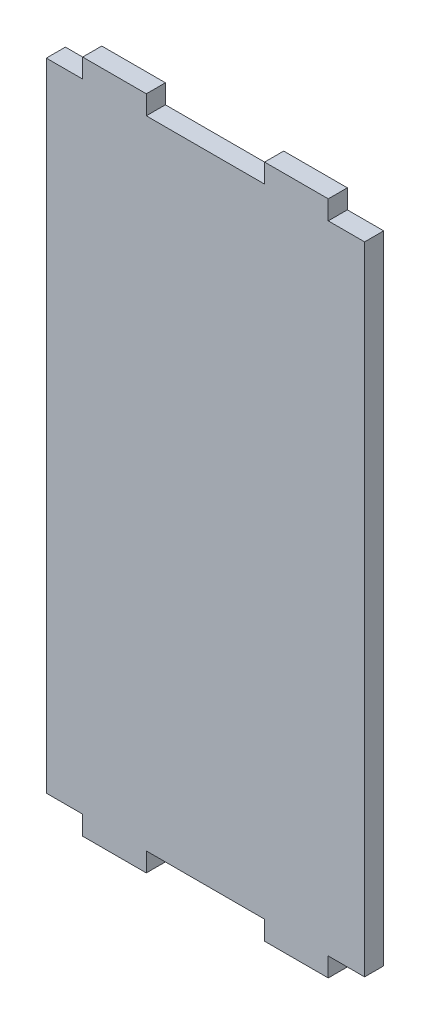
ISO-10303-21;
HEADER;
FILE_DESCRIPTION(('STEP AP214'),'2;1');
FILE_NAME('part.step','',(''),(''),'','','');
FILE_SCHEMA(('AUTOMOTIVE_DESIGN { 1 0 10303 214 1 1 1 1 }'));
ENDSEC;
DATA;
#1=APPLICATION_CONTEXT('core data for automotive mechanical design processes');
#2=APPLICATION_PROTOCOL_DEFINITION('international standard','automotive_design',2000,#1);
#3=PRODUCT_CONTEXT('',#1,'mechanical');
#4=PRODUCT('Part','Part','',(#3));
#5=PRODUCT_RELATED_PRODUCT_CATEGORY('part','',(#4));
#6=PRODUCT_DEFINITION_FORMATION('','',#4);
#7=PRODUCT_DEFINITION_CONTEXT('part definition',#1,'design');
#8=PRODUCT_DEFINITION('design','',#6,#7);
#9=PRODUCT_DEFINITION_SHAPE('','',#8);
#10=(LENGTH_UNIT() NAMED_UNIT(*) SI_UNIT(.MILLI.,.METRE.));
#11=(NAMED_UNIT(*) PLANE_ANGLE_UNIT() SI_UNIT($,.RADIAN.));
#12=(NAMED_UNIT(*) SI_UNIT($,.STERADIAN.) SOLID_ANGLE_UNIT());
#13=UNCERTAINTY_MEASURE_WITH_UNIT(LENGTH_MEASURE(1.E-05),#10,'distance_accuracy_value','');
#14=(GEOMETRIC_REPRESENTATION_CONTEXT(3) GLOBAL_UNCERTAINTY_ASSIGNED_CONTEXT((#13)) GLOBAL_UNIT_ASSIGNED_CONTEXT((#10,
#11,#12)) REPRESENTATION_CONTEXT('',''));
#15=CARTESIAN_POINT('',(0.,0.,0.));
#16=DIRECTION('',(0.,0.,1.));
#17=DIRECTION('',(1.,0.,0.));
#18=AXIS2_PLACEMENT_3D('',#15,#16,#17);
#19=CARTESIAN_POINT('',(25.,-3.,-3.));
#20=DIRECTION('',(1.,0.,0.));
#21=DIRECTION('',(0.,0.,-1.));
#22=AXIS2_PLACEMENT_3D('',#19,#20,#21);
#23=PLANE('',#22);
#24=DIRECTION('',(0.,1.,0.));
#25=VECTOR('',#24,1.);
#26=CARTESIAN_POINT('',(25.,-3.,0.));
#27=LINE('',#26,#25);
#28=CARTESIAN_POINT('',(25.,-103.,0.));
#29=VERTEX_POINT('',#28);
#30=CARTESIAN_POINT('',(25.,-3.,0.));
#31=VERTEX_POINT('',#30);
#32=EDGE_CURVE('E202',#29,#31,#27,.T.);
#33=ORIENTED_EDGE('',*,*,#32,.F.);
#34=DIRECTION('',(0.,0.,1.));
#35=VECTOR('',#34,1.);
#36=CARTESIAN_POINT('',(25.,-103.,-3.));
#37=LINE('',#36,#35);
#38=CARTESIAN_POINT('',(25.,-103.,-3.));
#39=VERTEX_POINT('',#38);
#40=EDGE_CURVE('E11',#39,#29,#37,.T.);
#41=ORIENTED_EDGE('',*,*,#40,.F.);
#42=DIRECTION('',(0.,1.,0.));
#43=VECTOR('',#42,1.);
#44=CARTESIAN_POINT('',(25.,-3.,-3.));
#45=LINE('',#44,#43);
#46=CARTESIAN_POINT('',(25.,-3.,-3.));
#47=VERTEX_POINT('',#46);
#48=EDGE_CURVE('E258',#39,#47,#45,.T.);
#49=ORIENTED_EDGE('',*,*,#48,.T.);
#50=DIRECTION('',(0.,0.,1.));
#51=VECTOR('',#50,1.);
#52=CARTESIAN_POINT('',(25.,-3.,-3.));
#53=LINE('',#52,#51);
#54=EDGE_CURVE('E36',#47,#31,#53,.T.);
#55=ORIENTED_EDGE('',*,*,#54,.T.);
#56=EDGE_LOOP('',(#33,#41,#49,#55));
#57=FACE_BOUND('',#56,.T.);
#58=ADVANCED_FACE('F33',(#57),#23,.T.);
#59=CARTESIAN_POINT('',(25.,-103.,-3.));
#60=DIRECTION('',(0.,-1.,0.));
#61=DIRECTION('',(0.,0.,-1.));
#62=AXIS2_PLACEMENT_3D('',#59,#60,#61);
#63=PLANE('',#62);
#64=DIRECTION('',(1.,0.,0.));
#65=VECTOR('',#64,1.);
#66=CARTESIAN_POINT('',(25.,-103.,0.));
#67=LINE('',#66,#65);
#68=CARTESIAN_POINT('',(19.2899615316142,-103.,0.));
#69=VERTEX_POINT('',#68);
#70=EDGE_CURVE('E256',#69,#29,#67,.T.);
#71=ORIENTED_EDGE('',*,*,#70,.F.);
#72=DIRECTION('',(0.,0.,1.));
#73=VECTOR('',#72,1.);
#74=CARTESIAN_POINT('',(19.2899615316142,-103.,-3.));
#75=LINE('',#74,#73);
#76=CARTESIAN_POINT('',(19.2899615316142,-103.,-3.));
#77=VERTEX_POINT('',#76);
#78=EDGE_CURVE('E42',#77,#69,#75,.T.);
#79=ORIENTED_EDGE('',*,*,#78,.F.);
#80=DIRECTION('',(1.,0.,0.));
#81=VECTOR('',#80,1.);
#82=CARTESIAN_POINT('',(25.,-103.,-3.));
#83=LINE('',#82,#81);
#84=EDGE_CURVE('E192',#77,#39,#83,.T.);
#85=ORIENTED_EDGE('',*,*,#84,.T.);
#86=ORIENTED_EDGE('',*,*,#40,.T.);
#87=EDGE_LOOP('',(#71,#79,#85,#86));
#88=FACE_BOUND('',#87,.T.);
#89=ADVANCED_FACE('F294',(#88),#63,.T.);
#90=CARTESIAN_POINT('',(19.2899615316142,-103.,-3.));
#91=DIRECTION('',(1.,0.,0.));
#92=DIRECTION('',(0.,0.,-1.));
#93=AXIS2_PLACEMENT_3D('',#90,#91,#92);
#94=PLANE('',#93);
#95=DIRECTION('',(0.,1.,0.));
#96=VECTOR('',#95,1.);
#97=CARTESIAN_POINT('',(19.2899615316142,-103.,0.));
#98=LINE('',#97,#96);
#99=CARTESIAN_POINT('',(19.2899615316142,-106.,0.));
#100=VERTEX_POINT('',#99);
#101=EDGE_CURVE('E179',#100,#69,#98,.T.);
#102=ORIENTED_EDGE('',*,*,#101,.F.);
#103=DIRECTION('',(0.,0.,1.));
#104=VECTOR('',#103,1.);
#105=CARTESIAN_POINT('',(19.2899615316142,-106.,-3.));
#106=LINE('',#105,#104);
#107=CARTESIAN_POINT('',(19.2899615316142,-106.,-3.));
#108=VERTEX_POINT('',#107);
#109=EDGE_CURVE('E174',#108,#100,#106,.T.);
#110=ORIENTED_EDGE('',*,*,#109,.F.);
#111=DIRECTION('',(0.,1.,0.));
#112=VECTOR('',#111,1.);
#113=CARTESIAN_POINT('',(19.2899615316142,-103.,-3.));
#114=LINE('',#113,#112);
#115=EDGE_CURVE('E177',#108,#77,#114,.T.);
#116=ORIENTED_EDGE('',*,*,#115,.T.);
#117=ORIENTED_EDGE('',*,*,#78,.T.);
#118=EDGE_LOOP('',(#102,#110,#116,#117));
#119=FACE_BOUND('',#118,.T.);
#120=ADVANCED_FACE('F176',(#119),#94,.T.);
#121=CARTESIAN_POINT('',(19.2899615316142,-106.,-3.));
#122=DIRECTION('',(0.,-1.,0.));
#123=DIRECTION('',(0.,0.,-1.));
#124=AXIS2_PLACEMENT_3D('',#121,#122,#123);
#125=PLANE('',#124);
#126=DIRECTION('',(1.,0.,0.));
#127=VECTOR('',#126,1.);
#128=CARTESIAN_POINT('',(19.2899615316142,-106.,0.));
#129=LINE('',#128,#127);
#130=CARTESIAN_POINT('',(9.28996153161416,-106.,0.));
#131=VERTEX_POINT('',#130);
#132=EDGE_CURVE('E253',#131,#100,#129,.T.);
#133=ORIENTED_EDGE('',*,*,#132,.F.);
#134=DIRECTION('',(0.,0.,1.));
#135=VECTOR('',#134,1.);
#136=CARTESIAN_POINT('',(9.28996153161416,-106.,-3.));
#137=LINE('',#136,#135);
#138=CARTESIAN_POINT('',(9.28996153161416,-106.,-3.));
#139=VERTEX_POINT('',#138);
#140=EDGE_CURVE('E184',#139,#131,#137,.T.);
#141=ORIENTED_EDGE('',*,*,#140,.F.);
#142=DIRECTION('',(1.,0.,0.));
#143=VECTOR('',#142,1.);
#144=CARTESIAN_POINT('',(19.2899615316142,-106.,-3.));
#145=LINE('',#144,#143);
#146=EDGE_CURVE('E190',#139,#108,#145,.T.);
#147=ORIENTED_EDGE('',*,*,#146,.T.);
#148=ORIENTED_EDGE('',*,*,#109,.T.);
#149=EDGE_LOOP('',(#133,#141,#147,#148));
#150=FACE_BOUND('',#149,.T.);
#151=ADVANCED_FACE('F194',(#150),#125,.T.);
#152=CARTESIAN_POINT('',(9.28996153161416,-106.,-3.));
#153=DIRECTION('',(-1.,0.,0.));
#154=DIRECTION('',(0.,-1.,0.));
#155=AXIS2_PLACEMENT_3D('',#152,#153,#154);
#156=PLANE('',#155);
#157=DIRECTION('',(0.,-1.,0.));
#158=VECTOR('',#157,1.);
#159=CARTESIAN_POINT('',(9.28996153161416,-106.,0.));
#160=LINE('',#159,#158);
#161=CARTESIAN_POINT('',(9.28996153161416,-103.,0.));
#162=VERTEX_POINT('',#161);
#163=EDGE_CURVE('E250',#162,#131,#160,.T.);
#164=ORIENTED_EDGE('',*,*,#163,.F.);
#165=DIRECTION('',(0.,0.,1.));
#166=VECTOR('',#165,1.);
#167=CARTESIAN_POINT('',(9.28996153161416,-103.,-3.));
#168=LINE('',#167,#166);
#169=CARTESIAN_POINT('',(9.28996153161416,-103.,-3.));
#170=VERTEX_POINT('',#169);
#171=EDGE_CURVE('E262',#170,#162,#168,.T.);
#172=ORIENTED_EDGE('',*,*,#171,.F.);
#173=DIRECTION('',(0.,-1.,0.));
#174=VECTOR('',#173,1.);
#175=CARTESIAN_POINT('',(9.28996153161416,-106.,-3.));
#176=LINE('',#175,#174);
#177=EDGE_CURVE('E195',#170,#139,#176,.T.);
#178=ORIENTED_EDGE('',*,*,#177,.T.);
#179=ORIENTED_EDGE('',*,*,#140,.T.);
#180=EDGE_LOOP('',(#164,#172,#178,#179));
#181=FACE_BOUND('',#180,.T.);
#182=ADVANCED_FACE('F307',(#181),#156,.T.);
#183=CARTESIAN_POINT('',(9.28996153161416,-103.,-3.));
#184=DIRECTION('',(0.,-1.,0.));
#185=DIRECTION('',(0.,0.,-1.));
#186=AXIS2_PLACEMENT_3D('',#183,#184,#185);
#187=PLANE('',#186);
#188=DIRECTION('',(1.,0.,0.));
#189=VECTOR('',#188,1.);
#190=CARTESIAN_POINT('',(9.28996153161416,-103.,0.));
#191=LINE('',#190,#189);
#192=CARTESIAN_POINT('',(-9.28996153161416,-103.,0.));
#193=VERTEX_POINT('',#192);
#194=EDGE_CURVE('E247',#193,#162,#191,.T.);
#195=ORIENTED_EDGE('',*,*,#194,.F.);
#196=DIRECTION('',(0.,0.,1.));
#197=VECTOR('',#196,1.);
#198=CARTESIAN_POINT('',(-9.28996153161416,-103.,-3.));
#199=LINE('',#198,#197);
#200=CARTESIAN_POINT('',(-9.28996153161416,-103.,-3.));
#201=VERTEX_POINT('',#200);
#202=EDGE_CURVE('E264',#201,#193,#199,.T.);
#203=ORIENTED_EDGE('',*,*,#202,.F.);
#204=DIRECTION('',(1.,0.,0.));
#205=VECTOR('',#204,1.);
#206=CARTESIAN_POINT('',(9.28996153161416,-103.,-3.));
#207=LINE('',#206,#205);
#208=EDGE_CURVE('E197',#201,#170,#207,.T.);
#209=ORIENTED_EDGE('',*,*,#208,.T.);
#210=ORIENTED_EDGE('',*,*,#171,.T.);
#211=EDGE_LOOP('',(#195,#203,#209,#210));
#212=FACE_BOUND('',#211,.T.);
#213=ADVANCED_FACE('F310',(#212),#187,.T.);
#214=CARTESIAN_POINT('',(-9.28996153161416,-106.,-3.));
#215=DIRECTION('',(1.,0.,0.));
#216=DIRECTION('',(0.,1.,0.));
#217=AXIS2_PLACEMENT_3D('',#214,#215,#216);
#218=PLANE('',#217);
#219=DIRECTION('',(0.,1.,0.));
#220=VECTOR('',#219,1.);
#221=CARTESIAN_POINT('',(-9.28996153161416,-106.,0.));
#222=LINE('',#221,#220);
#223=CARTESIAN_POINT('',(-9.28996153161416,-106.,0.));
#224=VERTEX_POINT('',#223);
#225=EDGE_CURVE('E244',#224,#193,#222,.T.);
#226=ORIENTED_EDGE('',*,*,#225,.F.);
#227=DIRECTION('',(0.,0.,1.));
#228=VECTOR('',#227,1.);
#229=CARTESIAN_POINT('',(-9.28996153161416,-106.,-3.));
#230=LINE('',#229,#228);
#231=CARTESIAN_POINT('',(-9.28996153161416,-106.,-3.));
#232=VERTEX_POINT('',#231);
#233=EDGE_CURVE('E266',#232,#224,#230,.T.);
#234=ORIENTED_EDGE('',*,*,#233,.F.);
#235=DIRECTION('',(0.,1.,0.));
#236=VECTOR('',#235,1.);
#237=CARTESIAN_POINT('',(-9.28996153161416,-106.,-3.));
#238=LINE('',#237,#236);
#239=EDGE_CURVE('E549',#232,#201,#238,.T.);
#240=ORIENTED_EDGE('',*,*,#239,.T.);
#241=ORIENTED_EDGE('',*,*,#202,.T.);
#242=EDGE_LOOP('',(#226,#234,#240,#241));
#243=FACE_BOUND('',#242,.T.);
#244=ADVANCED_FACE('F314',(#243),#218,.T.);
#245=CARTESIAN_POINT('',(-19.2899615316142,-106.,-3.));
#246=DIRECTION('',(0.,-1.,0.));
#247=DIRECTION('',(0.,0.,-1.));
#248=AXIS2_PLACEMENT_3D('',#245,#246,#247);
#249=PLANE('',#248);
#250=DIRECTION('',(1.,0.,0.));
#251=VECTOR('',#250,1.);
#252=CARTESIAN_POINT('',(-19.2899615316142,-106.,0.));
#253=LINE('',#252,#251);
#254=CARTESIAN_POINT('',(-19.2899615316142,-106.,0.));
#255=VERTEX_POINT('',#254);
#256=EDGE_CURVE('E241',#255,#224,#253,.T.);
#257=ORIENTED_EDGE('',*,*,#256,.F.);
#258=DIRECTION('',(0.,0.,1.));
#259=VECTOR('',#258,1.);
#260=CARTESIAN_POINT('',(-19.2899615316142,-106.,-3.));
#261=LINE('',#260,#259);
#262=CARTESIAN_POINT('',(-19.2899615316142,-106.,-3.));
#263=VERTEX_POINT('',#262);
#264=EDGE_CURVE('E268',#263,#255,#261,.T.);
#265=ORIENTED_EDGE('',*,*,#264,.F.);
#266=DIRECTION('',(1.,0.,0.));
#267=VECTOR('',#266,1.);
#268=CARTESIAN_POINT('',(-19.2899615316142,-106.,-3.));
#269=LINE('',#268,#267);
#270=EDGE_CURVE('E542',#263,#232,#269,.T.);
#271=ORIENTED_EDGE('',*,*,#270,.T.);
#272=ORIENTED_EDGE('',*,*,#233,.T.);
#273=EDGE_LOOP('',(#257,#265,#271,#272));
#274=FACE_BOUND('',#273,.T.);
#275=ADVANCED_FACE('F318',(#274),#249,.T.);
#276=CARTESIAN_POINT('',(-19.2899615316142,-103.,-3.));
#277=DIRECTION('',(-1.,0.,0.));
#278=DIRECTION('',(0.,0.,1.));
#279=AXIS2_PLACEMENT_3D('',#276,#277,#278);
#280=PLANE('',#279);
#281=DIRECTION('',(0.,-1.,0.));
#282=VECTOR('',#281,1.);
#283=CARTESIAN_POINT('',(-19.2899615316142,-103.,0.));
#284=LINE('',#283,#282);
#285=CARTESIAN_POINT('',(-19.2899615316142,-103.,0.));
#286=VERTEX_POINT('',#285);
#287=EDGE_CURVE('E238',#286,#255,#284,.T.);
#288=ORIENTED_EDGE('',*,*,#287,.F.);
#289=DIRECTION('',(0.,0.,1.));
#290=VECTOR('',#289,1.);
#291=CARTESIAN_POINT('',(-19.2899615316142,-103.,-3.));
#292=LINE('',#291,#290);
#293=CARTESIAN_POINT('',(-19.2899615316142,-103.,-3.));
#294=VERTEX_POINT('',#293);
#295=EDGE_CURVE('E270',#294,#286,#292,.T.);
#296=ORIENTED_EDGE('',*,*,#295,.F.);
#297=DIRECTION('',(0.,-1.,0.));
#298=VECTOR('',#297,1.);
#299=CARTESIAN_POINT('',(-19.2899615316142,-103.,-3.));
#300=LINE('',#299,#298);
#301=EDGE_CURVE('E538',#294,#263,#300,.T.);
#302=ORIENTED_EDGE('',*,*,#301,.T.);
#303=ORIENTED_EDGE('',*,*,#264,.T.);
#304=EDGE_LOOP('',(#288,#296,#302,#303));
#305=FACE_BOUND('',#304,.T.);
#306=ADVANCED_FACE('F322',(#305),#280,.T.);
#307=CARTESIAN_POINT('',(-25.,-103.,-3.));
#308=DIRECTION('',(0.,-1.,0.));
#309=DIRECTION('',(0.,0.,-1.));
#310=AXIS2_PLACEMENT_3D('',#307,#308,#309);
#311=PLANE('',#310);
#312=DIRECTION('',(1.,0.,0.));
#313=VECTOR('',#312,1.);
#314=CARTESIAN_POINT('',(-25.,-103.,0.));
#315=LINE('',#314,#313);
#316=CARTESIAN_POINT('',(-25.,-103.,0.));
#317=VERTEX_POINT('',#316);
#318=EDGE_CURVE('E235',#317,#286,#315,.T.);
#319=ORIENTED_EDGE('',*,*,#318,.F.);
#320=DIRECTION('',(0.,0.,1.));
#321=VECTOR('',#320,1.);
#322=CARTESIAN_POINT('',(-25.,-103.,-3.));
#323=LINE('',#322,#321);
#324=CARTESIAN_POINT('',(-25.,-103.,-3.));
#325=VERTEX_POINT('',#324);
#326=EDGE_CURVE('E272',#325,#317,#323,.T.);
#327=ORIENTED_EDGE('',*,*,#326,.F.);
#328=DIRECTION('',(1.,0.,0.));
#329=VECTOR('',#328,1.);
#330=CARTESIAN_POINT('',(-25.,-103.,-3.));
#331=LINE('',#330,#329);
#332=EDGE_CURVE('E554',#325,#294,#331,.T.);
#333=ORIENTED_EDGE('',*,*,#332,.T.);
#334=ORIENTED_EDGE('',*,*,#295,.T.);
#335=EDGE_LOOP('',(#319,#327,#333,#334));
#336=FACE_BOUND('',#335,.T.);
#337=ADVANCED_FACE('F326',(#336),#311,.T.);
#338=CARTESIAN_POINT('',(-25.,-3.,-3.));
#339=DIRECTION('',(-1.,0.,0.));
#340=DIRECTION('',(0.,0.,1.));
#341=AXIS2_PLACEMENT_3D('',#338,#339,#340);
#342=PLANE('',#341);
#343=DIRECTION('',(0.,-1.,0.));
#344=VECTOR('',#343,1.);
#345=CARTESIAN_POINT('',(-25.,-3.,0.));
#346=LINE('',#345,#344);
#347=CARTESIAN_POINT('',(-25.,-3.,0.));
#348=VERTEX_POINT('',#347);
#349=EDGE_CURVE('E232',#348,#317,#346,.T.);
#350=ORIENTED_EDGE('',*,*,#349,.F.);
#351=DIRECTION('',(0.,0.,1.));
#352=VECTOR('',#351,1.);
#353=CARTESIAN_POINT('',(-25.,-3.,-3.));
#354=LINE('',#353,#352);
#355=CARTESIAN_POINT('',(-25.,-3.,-3.));
#356=VERTEX_POINT('',#355);
#357=EDGE_CURVE('E274',#356,#348,#354,.T.);
#358=ORIENTED_EDGE('',*,*,#357,.F.);
#359=DIRECTION('',(0.,-1.,0.));
#360=VECTOR('',#359,1.);
#361=CARTESIAN_POINT('',(-25.,-3.,-3.));
#362=LINE('',#361,#360);
#363=EDGE_CURVE('E531',#356,#325,#362,.T.);
#364=ORIENTED_EDGE('',*,*,#363,.T.);
#365=ORIENTED_EDGE('',*,*,#326,.T.);
#366=EDGE_LOOP('',(#350,#358,#364,#365));
#367=FACE_BOUND('',#366,.T.);
#368=ADVANCED_FACE('F330',(#367),#342,.T.);
#369=CARTESIAN_POINT('',(-25.,-3.,-3.));
#370=DIRECTION('',(0.,1.,0.));
#371=DIRECTION('',(0.,0.,1.));
#372=AXIS2_PLACEMENT_3D('',#369,#370,#371);
#373=PLANE('',#372);
#374=DIRECTION('',(-1.,0.,0.));
#375=VECTOR('',#374,1.);
#376=CARTESIAN_POINT('',(-25.,-3.,0.));
#377=LINE('',#376,#375);
#378=CARTESIAN_POINT('',(-19.2899615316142,-3.,0.));
#379=VERTEX_POINT('',#378);
#380=EDGE_CURVE('E229',#379,#348,#377,.T.);
#381=ORIENTED_EDGE('',*,*,#380,.F.);
#382=DIRECTION('',(0.,0.,1.));
#383=VECTOR('',#382,1.);
#384=CARTESIAN_POINT('',(-19.2899615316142,-3.,-3.));
#385=LINE('',#384,#383);
#386=CARTESIAN_POINT('',(-19.2899615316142,-3.,-3.));
#387=VERTEX_POINT('',#386);
#388=EDGE_CURVE('E276',#387,#379,#385,.T.);
#389=ORIENTED_EDGE('',*,*,#388,.F.);
#390=DIRECTION('',(-1.,0.,0.));
#391=VECTOR('',#390,1.);
#392=CARTESIAN_POINT('',(-25.,-3.,-3.));
#393=LINE('',#392,#391);
#394=EDGE_CURVE('E527',#387,#356,#393,.T.);
#395=ORIENTED_EDGE('',*,*,#394,.T.);
#396=ORIENTED_EDGE('',*,*,#357,.T.);
#397=EDGE_LOOP('',(#381,#389,#395,#396));
#398=FACE_BOUND('',#397,.T.);
#399=ADVANCED_FACE('F334',(#398),#373,.T.);
#400=CARTESIAN_POINT('',(-19.2899615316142,-3.,-3.));
#401=DIRECTION('',(-1.,0.,0.));
#402=DIRECTION('',(0.,0.,1.));
#403=AXIS2_PLACEMENT_3D('',#400,#401,#402);
#404=PLANE('',#403);
#405=DIRECTION('',(0.,-1.,0.));
#406=VECTOR('',#405,1.);
#407=CARTESIAN_POINT('',(-19.2899615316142,-3.,0.));
#408=LINE('',#407,#406);
#409=CARTESIAN_POINT('',(-19.2899615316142,0.,0.));
#410=VERTEX_POINT('',#409);
#411=EDGE_CURVE('E226',#410,#379,#408,.T.);
#412=ORIENTED_EDGE('',*,*,#411,.F.);
#413=DIRECTION('',(0.,0.,1.));
#414=VECTOR('',#413,1.);
#415=CARTESIAN_POINT('',(-19.2899615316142,0.,-3.));
#416=LINE('',#415,#414);
#417=CARTESIAN_POINT('',(-19.2899615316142,0.,-3.));
#418=VERTEX_POINT('',#417);
#419=EDGE_CURVE('E278',#418,#410,#416,.T.);
#420=ORIENTED_EDGE('',*,*,#419,.F.);
#421=DIRECTION('',(0.,-1.,0.));
#422=VECTOR('',#421,1.);
#423=CARTESIAN_POINT('',(-19.2899615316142,-3.,-3.));
#424=LINE('',#423,#422);
#425=EDGE_CURVE('E558',#418,#387,#424,.T.);
#426=ORIENTED_EDGE('',*,*,#425,.T.);
#427=ORIENTED_EDGE('',*,*,#388,.T.);
#428=EDGE_LOOP('',(#412,#420,#426,#427));
#429=FACE_BOUND('',#428,.T.);
#430=ADVANCED_FACE('F338',(#429),#404,.T.);
#431=CARTESIAN_POINT('',(-19.2899615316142,0.,-3.));
#432=DIRECTION('',(0.,1.,0.));
#433=DIRECTION('',(-1.,0.,0.));
#434=AXIS2_PLACEMENT_3D('',#431,#432,#433);
#435=PLANE('',#434);
#436=DIRECTION('',(-1.,0.,0.));
#437=VECTOR('',#436,1.);
#438=CARTESIAN_POINT('',(-19.2899615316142,0.,0.));
#439=LINE('',#438,#437);
#440=CARTESIAN_POINT('',(-9.28996153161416,0.,0.));
#441=VERTEX_POINT('',#440);
#442=EDGE_CURVE('E223',#441,#410,#439,.T.);
#443=ORIENTED_EDGE('',*,*,#442,.F.);
#444=DIRECTION('',(0.,0.,1.));
#445=VECTOR('',#444,1.);
#446=CARTESIAN_POINT('',(-9.28996153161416,0.,-3.));
#447=LINE('',#446,#445);
#448=CARTESIAN_POINT('',(-9.28996153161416,0.,-3.));
#449=VERTEX_POINT('',#448);
#450=EDGE_CURVE('E280',#449,#441,#447,.T.);
#451=ORIENTED_EDGE('',*,*,#450,.F.);
#452=DIRECTION('',(-1.,0.,0.));
#453=VECTOR('',#452,1.);
#454=CARTESIAN_POINT('',(-19.2899615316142,0.,-3.));
#455=LINE('',#454,#453);
#456=EDGE_CURVE('E520',#449,#418,#455,.T.);
#457=ORIENTED_EDGE('',*,*,#456,.T.);
#458=ORIENTED_EDGE('',*,*,#419,.T.);
#459=EDGE_LOOP('',(#443,#451,#457,#458));
#460=FACE_BOUND('',#459,.T.);
#461=ADVANCED_FACE('F342',(#460),#435,.T.);
#462=CARTESIAN_POINT('',(-9.28996153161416,0.,-3.));
#463=DIRECTION('',(1.,0.,0.));
#464=DIRECTION('',(0.,1.,0.));
#465=AXIS2_PLACEMENT_3D('',#462,#463,#464);
#466=PLANE('',#465);
#467=DIRECTION('',(0.,1.,0.));
#468=VECTOR('',#467,1.);
#469=CARTESIAN_POINT('',(-9.28996153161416,0.,0.));
#470=LINE('',#469,#468);
#471=CARTESIAN_POINT('',(-9.28996153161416,-3.,0.));
#472=VERTEX_POINT('',#471);
#473=EDGE_CURVE('E220',#472,#441,#470,.T.);
#474=ORIENTED_EDGE('',*,*,#473,.F.);
#475=DIRECTION('',(0.,0.,1.));
#476=VECTOR('',#475,1.);
#477=CARTESIAN_POINT('',(-9.28996153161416,-3.,-3.));
#478=LINE('',#477,#476);
#479=CARTESIAN_POINT('',(-9.28996153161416,-3.,-3.));
#480=VERTEX_POINT('',#479);
#481=EDGE_CURVE('E282',#480,#472,#478,.T.);
#482=ORIENTED_EDGE('',*,*,#481,.F.);
#483=DIRECTION('',(0.,1.,0.));
#484=VECTOR('',#483,1.);
#485=CARTESIAN_POINT('',(-9.28996153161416,0.,-3.));
#486=LINE('',#485,#484);
#487=EDGE_CURVE('E516',#480,#449,#486,.T.);
#488=ORIENTED_EDGE('',*,*,#487,.T.);
#489=ORIENTED_EDGE('',*,*,#450,.T.);
#490=EDGE_LOOP('',(#474,#482,#488,#489));
#491=FACE_BOUND('',#490,.T.);
#492=ADVANCED_FACE('F346',(#491),#466,.T.);
#493=CARTESIAN_POINT('',(9.28996153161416,-3.,-3.));
#494=DIRECTION('',(0.,1.,0.));
#495=DIRECTION('',(-1.,0.,0.));
#496=AXIS2_PLACEMENT_3D('',#493,#494,#495);
#497=PLANE('',#496);
#498=DIRECTION('',(-1.,0.,0.));
#499=VECTOR('',#498,1.);
#500=CARTESIAN_POINT('',(9.28996153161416,-3.,0.));
#501=LINE('',#500,#499);
#502=CARTESIAN_POINT('',(9.28996153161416,-3.,0.));
#503=VERTEX_POINT('',#502);
#504=EDGE_CURVE('E217',#503,#472,#501,.T.);
#505=ORIENTED_EDGE('',*,*,#504,.F.);
#506=DIRECTION('',(0.,0.,1.));
#507=VECTOR('',#506,1.);
#508=CARTESIAN_POINT('',(9.28996153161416,-3.,-3.));
#509=LINE('',#508,#507);
#510=CARTESIAN_POINT('',(9.28996153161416,-3.,-3.));
#511=VERTEX_POINT('',#510);
#512=EDGE_CURVE('E284',#511,#503,#509,.T.);
#513=ORIENTED_EDGE('',*,*,#512,.F.);
#514=DIRECTION('',(-1.,0.,0.));
#515=VECTOR('',#514,1.);
#516=CARTESIAN_POINT('',(9.28996153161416,-3.,-3.));
#517=LINE('',#516,#515);
#518=EDGE_CURVE('E562',#511,#480,#517,.T.);
#519=ORIENTED_EDGE('',*,*,#518,.T.);
#520=ORIENTED_EDGE('',*,*,#481,.T.);
#521=EDGE_LOOP('',(#505,#513,#519,#520));
#522=FACE_BOUND('',#521,.T.);
#523=ADVANCED_FACE('F350',(#522),#497,.T.);
#524=CARTESIAN_POINT('',(9.28996153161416,0.,-3.));
#525=DIRECTION('',(-1.,0.,0.));
#526=DIRECTION('',(0.,-1.,0.));
#527=AXIS2_PLACEMENT_3D('',#524,#525,#526);
#528=PLANE('',#527);
#529=DIRECTION('',(0.,-1.,0.));
#530=VECTOR('',#529,1.);
#531=CARTESIAN_POINT('',(9.28996153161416,0.,0.));
#532=LINE('',#531,#530);
#533=CARTESIAN_POINT('',(9.28996153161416,0.,0.));
#534=VERTEX_POINT('',#533);
#535=EDGE_CURVE('E214',#534,#503,#532,.T.);
#536=ORIENTED_EDGE('',*,*,#535,.F.);
#537=DIRECTION('',(0.,0.,1.));
#538=VECTOR('',#537,1.);
#539=CARTESIAN_POINT('',(9.28996153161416,0.,-3.));
#540=LINE('',#539,#538);
#541=CARTESIAN_POINT('',(9.28996153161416,0.,-3.));
#542=VERTEX_POINT('',#541);
#543=EDGE_CURVE('E286',#542,#534,#540,.T.);
#544=ORIENTED_EDGE('',*,*,#543,.F.);
#545=DIRECTION('',(0.,-1.,0.));
#546=VECTOR('',#545,1.);
#547=CARTESIAN_POINT('',(9.28996153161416,0.,-3.));
#548=LINE('',#547,#546);
#549=EDGE_CURVE('E509',#542,#511,#548,.T.);
#550=ORIENTED_EDGE('',*,*,#549,.T.);
#551=ORIENTED_EDGE('',*,*,#512,.T.);
#552=EDGE_LOOP('',(#536,#544,#550,#551));
#553=FACE_BOUND('',#552,.T.);
#554=ADVANCED_FACE('F354',(#553),#528,.T.);
#555=CARTESIAN_POINT('',(19.2899615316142,0.,-3.));
#556=DIRECTION('',(0.,1.,0.));
#557=DIRECTION('',(0.,0.,1.));
#558=AXIS2_PLACEMENT_3D('',#555,#556,#557);
#559=PLANE('',#558);
#560=DIRECTION('',(-1.,0.,0.));
#561=VECTOR('',#560,1.);
#562=CARTESIAN_POINT('',(19.2899615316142,0.,0.));
#563=LINE('',#562,#561);
#564=CARTESIAN_POINT('',(19.2899615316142,0.,0.));
#565=VERTEX_POINT('',#564);
#566=EDGE_CURVE('E211',#565,#534,#563,.T.);
#567=ORIENTED_EDGE('',*,*,#566,.F.);
#568=DIRECTION('',(0.,0.,1.));
#569=VECTOR('',#568,1.);
#570=CARTESIAN_POINT('',(19.2899615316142,0.,-3.));
#571=LINE('',#570,#569);
#572=CARTESIAN_POINT('',(19.2899615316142,0.,-3.));
#573=VERTEX_POINT('',#572);
#574=EDGE_CURVE('E288',#573,#565,#571,.T.);
#575=ORIENTED_EDGE('',*,*,#574,.F.);
#576=DIRECTION('',(-1.,0.,0.));
#577=VECTOR('',#576,1.);
#578=CARTESIAN_POINT('',(19.2899615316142,0.,-3.));
#579=LINE('',#578,#577);
#580=EDGE_CURVE('E505',#573,#542,#579,.T.);
#581=ORIENTED_EDGE('',*,*,#580,.T.);
#582=ORIENTED_EDGE('',*,*,#543,.T.);
#583=EDGE_LOOP('',(#567,#575,#581,#582));
#584=FACE_BOUND('',#583,.T.);
#585=ADVANCED_FACE('F358',(#584),#559,.T.);
#586=CARTESIAN_POINT('',(19.2899615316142,-3.,-3.));
#587=DIRECTION('',(1.,0.,0.));
#588=DIRECTION('',(0.,0.,-1.));
#589=AXIS2_PLACEMENT_3D('',#586,#587,#588);
#590=PLANE('',#589);
#591=DIRECTION('',(0.,1.,0.));
#592=VECTOR('',#591,1.);
#593=CARTESIAN_POINT('',(19.2899615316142,-3.,0.));
#594=LINE('',#593,#592);
#595=CARTESIAN_POINT('',(19.2899615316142,-3.,0.));
#596=VERTEX_POINT('',#595);
#597=EDGE_CURVE('E208',#596,#565,#594,.T.);
#598=ORIENTED_EDGE('',*,*,#597,.F.);
#599=DIRECTION('',(0.,0.,1.));
#600=VECTOR('',#599,1.);
#601=CARTESIAN_POINT('',(19.2899615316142,-3.,-3.));
#602=LINE('',#601,#600);
#603=CARTESIAN_POINT('',(19.2899615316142,-3.,-3.));
#604=VERTEX_POINT('',#603);
#605=EDGE_CURVE('E289',#604,#596,#602,.T.);
#606=ORIENTED_EDGE('',*,*,#605,.F.);
#607=DIRECTION('',(0.,1.,0.));
#608=VECTOR('',#607,1.);
#609=CARTESIAN_POINT('',(19.2899615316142,-3.,-3.));
#610=LINE('',#609,#608);
#611=EDGE_CURVE('E566',#604,#573,#610,.T.);
#612=ORIENTED_EDGE('',*,*,#611,.T.);
#613=ORIENTED_EDGE('',*,*,#574,.T.);
#614=EDGE_LOOP('',(#598,#606,#612,#613));
#615=FACE_BOUND('',#614,.T.);
#616=ADVANCED_FACE('F362',(#615),#590,.T.);
#617=CARTESIAN_POINT('',(25.,-3.,-3.));
#618=DIRECTION('',(0.,1.,0.));
#619=DIRECTION('',(0.,0.,1.));
#620=AXIS2_PLACEMENT_3D('',#617,#618,#619);
#621=PLANE('',#620);
#622=DIRECTION('',(-1.,0.,0.));
#623=VECTOR('',#622,1.);
#624=CARTESIAN_POINT('',(25.,-3.,0.));
#625=LINE('',#624,#623);
#626=EDGE_CURVE('E205',#31,#596,#625,.T.);
#627=ORIENTED_EDGE('',*,*,#626,.F.);
#628=ORIENTED_EDGE('',*,*,#54,.F.);
#629=DIRECTION('',(-1.,0.,0.));
#630=VECTOR('',#629,1.);
#631=CARTESIAN_POINT('',(25.,-3.,-3.));
#632=LINE('',#631,#630);
#633=EDGE_CURVE('E568',#47,#604,#632,.T.);
#634=ORIENTED_EDGE('',*,*,#633,.T.);
#635=ORIENTED_EDGE('',*,*,#605,.T.);
#636=EDGE_LOOP('',(#627,#628,#634,#635));
#637=FACE_BOUND('',#636,.T.);
#638=ADVANCED_FACE('F291',(#637),#621,.T.);
#639=CARTESIAN_POINT('',(0.,0.,-3.));
#640=DIRECTION('',(0.,0.,-1.));
#641=DIRECTION('',(-1.,0.,0.));
#642=AXIS2_PLACEMENT_3D('',#639,#640,#641);
#643=PLANE('',#642);
#644=ORIENTED_EDGE('',*,*,#48,.F.);
#645=ORIENTED_EDGE('',*,*,#84,.F.);
#646=ORIENTED_EDGE('',*,*,#115,.F.);
#647=ORIENTED_EDGE('',*,*,#146,.F.);
#648=ORIENTED_EDGE('',*,*,#177,.F.);
#649=ORIENTED_EDGE('',*,*,#208,.F.);
#650=ORIENTED_EDGE('',*,*,#239,.F.);
#651=ORIENTED_EDGE('',*,*,#270,.F.);
#652=ORIENTED_EDGE('',*,*,#301,.F.);
#653=ORIENTED_EDGE('',*,*,#332,.F.);
#654=ORIENTED_EDGE('',*,*,#363,.F.);
#655=ORIENTED_EDGE('',*,*,#394,.F.);
#656=ORIENTED_EDGE('',*,*,#425,.F.);
#657=ORIENTED_EDGE('',*,*,#456,.F.);
#658=ORIENTED_EDGE('',*,*,#487,.F.);
#659=ORIENTED_EDGE('',*,*,#518,.F.);
#660=ORIENTED_EDGE('',*,*,#549,.F.);
#661=ORIENTED_EDGE('',*,*,#580,.F.);
#662=ORIENTED_EDGE('',*,*,#611,.F.);
#663=ORIENTED_EDGE('',*,*,#633,.F.);
#664=EDGE_LOOP('',(#644,#645,#646,#647,#648,#649,#650,#651,#652,#653,#654,#655,#656,#657,#658,
#659,#660,#661,#662,#663));
#665=FACE_BOUND('',#664,.T.);
#666=ADVANCED_FACE('F188',(#665),#643,.T.);
#667=CARTESIAN_POINT('',(0.,0.,0.));
#668=DIRECTION('',(0.,0.,-1.));
#669=DIRECTION('',(-1.,0.,0.));
#670=AXIS2_PLACEMENT_3D('',#667,#668,#669);
#671=PLANE('',#670);
#672=ORIENTED_EDGE('',*,*,#32,.T.);
#673=ORIENTED_EDGE('',*,*,#626,.T.);
#674=ORIENTED_EDGE('',*,*,#597,.T.);
#675=ORIENTED_EDGE('',*,*,#566,.T.);
#676=ORIENTED_EDGE('',*,*,#535,.T.);
#677=ORIENTED_EDGE('',*,*,#504,.T.);
#678=ORIENTED_EDGE('',*,*,#473,.T.);
#679=ORIENTED_EDGE('',*,*,#442,.T.);
#680=ORIENTED_EDGE('',*,*,#411,.T.);
#681=ORIENTED_EDGE('',*,*,#380,.T.);
#682=ORIENTED_EDGE('',*,*,#349,.T.);
#683=ORIENTED_EDGE('',*,*,#318,.T.);
#684=ORIENTED_EDGE('',*,*,#287,.T.);
#685=ORIENTED_EDGE('',*,*,#256,.T.);
#686=ORIENTED_EDGE('',*,*,#225,.T.);
#687=ORIENTED_EDGE('',*,*,#194,.T.);
#688=ORIENTED_EDGE('',*,*,#163,.T.);
#689=ORIENTED_EDGE('',*,*,#132,.T.);
#690=ORIENTED_EDGE('',*,*,#101,.T.);
#691=ORIENTED_EDGE('',*,*,#70,.T.);
#692=EDGE_LOOP('',(#672,#673,#674,#675,#676,#677,#678,#679,#680,#681,#682,#683,#684,#685,#686,
#687,#688,#689,#690,#691));
#693=FACE_BOUND('',#692,.T.);
#694=ADVANCED_FACE('F293',(#693),#671,.F.);
#695=CLOSED_SHELL('',(#58,#89,#120,#151,#182,#213,#244,#275,#306,#337,#368,#399,#430,#461,#492,
#523,#554,#585,#616,#638,#666,#694));
#696=MANIFOLD_SOLID_BREP('B2',#695);
#697=ADVANCED_BREP_SHAPE_REPRESENTATION('',(#18,#696),#14);
#698=SHAPE_DEFINITION_REPRESENTATION(#9,#697);
ENDSEC;
END-ISO-10303-21;
